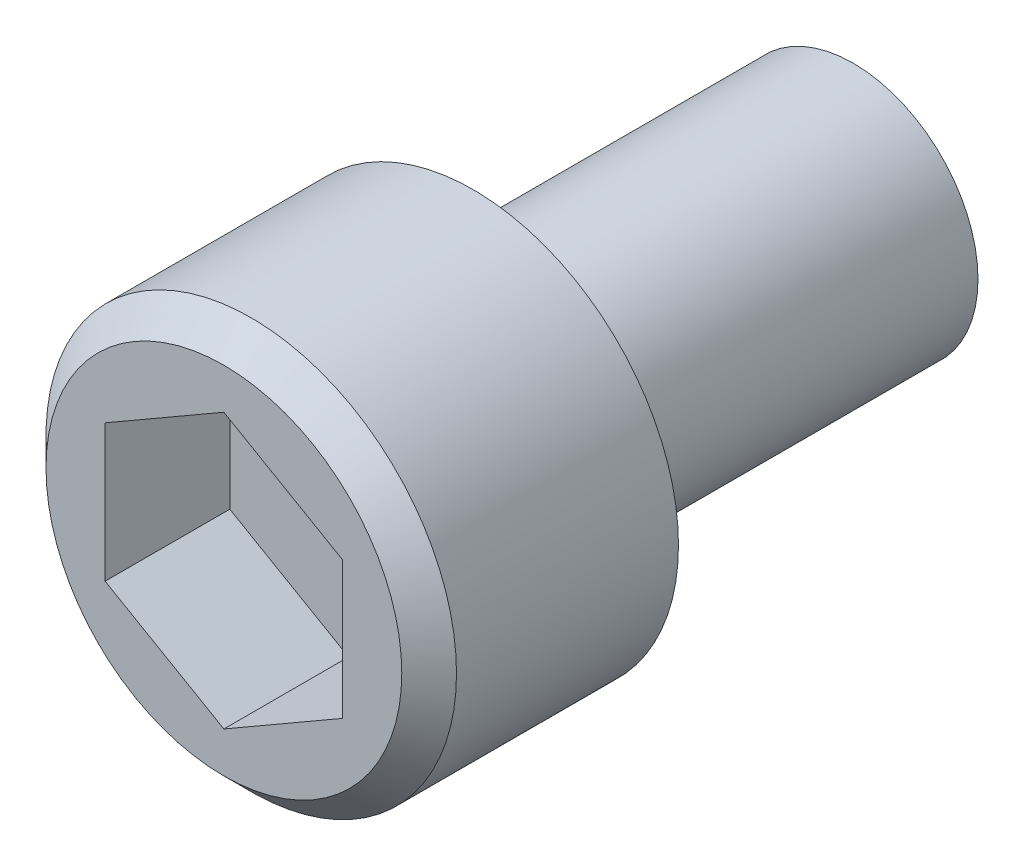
ISO-10303-21;
HEADER;
FILE_DESCRIPTION(('STEP AP214'),'2;1');
FILE_NAME('part.step','',(''),(''),'','','');
FILE_SCHEMA(('AUTOMOTIVE_DESIGN { 1 0 10303 214 1 1 1 1 }'));
ENDSEC;
DATA;
#1=APPLICATION_CONTEXT('core data for automotive mechanical design processes');
#2=APPLICATION_PROTOCOL_DEFINITION('international standard','automotive_design',2000,#1);
#3=PRODUCT_CONTEXT('',#1,'mechanical');
#4=PRODUCT('Part','Part','',(#3));
#5=PRODUCT_RELATED_PRODUCT_CATEGORY('part','',(#4));
#6=PRODUCT_DEFINITION_FORMATION('','',#4);
#7=PRODUCT_DEFINITION_CONTEXT('part definition',#1,'design');
#8=PRODUCT_DEFINITION('design','',#6,#7);
#9=PRODUCT_DEFINITION_SHAPE('','',#8);
#10=(LENGTH_UNIT() NAMED_UNIT(*) SI_UNIT(.MILLI.,.METRE.));
#11=(NAMED_UNIT(*) PLANE_ANGLE_UNIT() SI_UNIT($,.RADIAN.));
#12=(NAMED_UNIT(*) SI_UNIT($,.STERADIAN.) SOLID_ANGLE_UNIT());
#13=UNCERTAINTY_MEASURE_WITH_UNIT(LENGTH_MEASURE(1.E-05),#10,'distance_accuracy_value','');
#14=(GEOMETRIC_REPRESENTATION_CONTEXT(3) GLOBAL_UNCERTAINTY_ASSIGNED_CONTEXT((#13)) GLOBAL_UNIT_ASSIGNED_CONTEXT((#10,
#11,#12)) REPRESENTATION_CONTEXT('',''));
#15=CARTESIAN_POINT('',(0.,0.,0.));
#16=DIRECTION('',(0.,0.,1.));
#17=DIRECTION('',(1.,0.,0.));
#18=AXIS2_PLACEMENT_3D('',#15,#16,#17);
#19=CARTESIAN_POINT('',(0.,0.,6.35));
#20=DIRECTION('',(0.,0.,-1.));
#21=DIRECTION('',(-1.,0.,0.));
#22=AXIS2_PLACEMENT_3D('',#19,#20,#21);
#23=CYLINDRICAL_SURFACE('',#22,2.0828);
#24=CARTESIAN_POINT('',(0.,0.,6.0452));
#25=DIRECTION('',(0.,0.,1.));
#26=DIRECTION('',(1.,0.,0.));
#27=AXIS2_PLACEMENT_3D('',#24,#25,#26);
#28=CIRCLE('',#27,2.0828);
#29=CARTESIAN_POINT('',(2.0828,0.,6.0452));
#30=VERTEX_POINT('',#29);
#31=EDGE_CURVE('E154',#30,#30,#28,.F.);
#32=ORIENTED_EDGE('',*,*,#31,.T.);
#33=EDGE_LOOP('',(#32));
#34=FACE_BOUND('',#33,.T.);
#35=CARTESIAN_POINT('',(0.,0.,0.));
#36=DIRECTION('',(0.,0.,1.));
#37=DIRECTION('',(1.,0.,0.));
#38=AXIS2_PLACEMENT_3D('',#35,#36,#37);
#39=CIRCLE('',#38,2.0828);
#40=CARTESIAN_POINT('',(2.0828,0.,0.));
#41=VERTEX_POINT('',#40);
#42=EDGE_CURVE('E148',#41,#41,#39,.T.);
#43=ORIENTED_EDGE('',*,*,#42,.T.);
#44=EDGE_LOOP('',(#43));
#45=FACE_BOUND('',#44,.T.);
#46=ADVANCED_FACE('F38',(#34,#45),#23,.T.);
#47=CARTESIAN_POINT('',(0.,0.,0.));
#48=DIRECTION('',(0.,0.,1.));
#49=DIRECTION('',(1.,0.,0.));
#50=AXIS2_PLACEMENT_3D('',#47,#48,#49);
#51=PLANE('',#50);
#52=ORIENTED_EDGE('',*,*,#42,.F.);
#53=EDGE_LOOP('',(#52));
#54=FACE_BOUND('',#53,.T.);
#55=ADVANCED_FACE('F171',(#54),#51,.F.);
#56=CARTESIAN_POINT('',(0.,0.,6.35));
#57=DIRECTION('',(0.,0.,1.));
#58=DIRECTION('',(1.,0.,0.));
#59=AXIS2_PLACEMENT_3D('',#56,#57,#58);
#60=PLANE('',#59);
#61=CARTESIAN_POINT('',(0.,0.,6.35));
#62=DIRECTION('',(0.,0.,1.));
#63=DIRECTION('',(1.,0.,0.));
#64=AXIS2_PLACEMENT_3D('',#61,#62,#63);
#65=CIRCLE('',#64,2.3876);
#66=CARTESIAN_POINT('',(2.3876,0.,6.35));
#67=VERTEX_POINT('',#66);
#68=EDGE_CURVE('E151',#67,#67,#65,.T.);
#69=ORIENTED_EDGE('',*,*,#68,.T.);
#70=EDGE_LOOP('',(#69));
#71=FACE_BOUND('',#70,.T.);
#72=CARTESIAN_POINT('',(0.,0.,6.35));
#73=DIRECTION('',(0.,0.,1.));
#74=DIRECTION('',(1.,0.,0.));
#75=AXIS2_PLACEMENT_3D('',#72,#73,#74);
#76=CIRCLE('',#75,3.429);
#77=CARTESIAN_POINT('',(3.429,0.,6.35));
#78=VERTEX_POINT('',#77);
#79=EDGE_CURVE('E140',#78,#78,#76,.T.);
#80=ORIENTED_EDGE('',*,*,#79,.F.);
#81=EDGE_LOOP('',(#80));
#82=FACE_BOUND('',#81,.T.);
#83=ADVANCED_FACE('F177',(#71,#82),#60,.F.);
#84=CARTESIAN_POINT('',(0.,0.,10.5156));
#85=DIRECTION('',(0.,0.,-1.));
#86=DIRECTION('',(-1.,0.,0.));
#87=AXIS2_PLACEMENT_3D('',#84,#85,#86);
#88=CYLINDRICAL_SURFACE('',#87,3.429);
#89=CARTESIAN_POINT('',(0.,0.,10.0584));
#90=DIRECTION('',(0.,0.,1.));
#91=DIRECTION('',(1.,0.,0.));
#92=AXIS2_PLACEMENT_3D('',#89,#90,#91);
#93=CIRCLE('',#92,3.429);
#94=CARTESIAN_POINT('',(3.429,0.,10.0584));
#95=VERTEX_POINT('',#94);
#96=EDGE_CURVE('E11',#95,#95,#93,.F.);
#97=ORIENTED_EDGE('',*,*,#96,.T.);
#98=EDGE_LOOP('',(#97));
#99=FACE_BOUND('',#98,.T.);
#100=ORIENTED_EDGE('',*,*,#79,.T.);
#101=EDGE_LOOP('',(#100));
#102=FACE_BOUND('',#101,.T.);
#103=ADVANCED_FACE('F192',(#99,#102),#88,.T.);
#104=CARTESIAN_POINT('',(0.,0.,10.5156));
#105=DIRECTION('',(0.,0.,1.));
#106=DIRECTION('',(1.,0.,0.));
#107=AXIS2_PLACEMENT_3D('',#104,#105,#106);
#108=PLANE('',#107);
#109=CARTESIAN_POINT('',(0.,0.,10.5156));
#110=DIRECTION('',(0.,0.,1.));
#111=DIRECTION('',(1.,0.,0.));
#112=AXIS2_PLACEMENT_3D('',#109,#110,#111);
#113=CIRCLE('',#112,2.97179999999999);
#114=CARTESIAN_POINT('',(2.97179999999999,0.,10.5156));
#115=VERTEX_POINT('',#114);
#116=EDGE_CURVE('E46',#115,#115,#113,.T.);
#117=ORIENTED_EDGE('',*,*,#116,.T.);
#118=EDGE_LOOP('',(#117));
#119=FACE_BOUND('',#118,.T.);
#120=DIRECTION('',(-0.866025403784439,-0.5,0.));
#121=VECTOR('',#120,1.);
#122=CARTESIAN_POINT('',(0.,2.29135888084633,10.5156000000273));
#123=LINE('',#122,#121);
#124=CARTESIAN_POINT('',(0.,2.29135888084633,10.5156000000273));
#125=VERTEX_POINT('',#124);
#126=CARTESIAN_POINT('',(-1.984375,1.14567944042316,10.5156));
#127=VERTEX_POINT('',#126);
#128=EDGE_CURVE('E53',#125,#127,#123,.T.);
#129=ORIENTED_EDGE('',*,*,#128,.F.);
#130=DIRECTION('',(0.866025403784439,-0.5,0.));
#131=VECTOR('',#130,1.);
#132=CARTESIAN_POINT('',(0.,2.29135888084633,10.5156000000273));
#133=LINE('',#132,#131);
#134=CARTESIAN_POINT('',(1.984375,1.14567944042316,10.5156000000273));
#135=VERTEX_POINT('',#134);
#136=EDGE_CURVE('E135',#125,#135,#133,.T.);
#137=ORIENTED_EDGE('',*,*,#136,.T.);
#138=DIRECTION('',(0.,-1.,0.));
#139=VECTOR('',#138,1.);
#140=CARTESIAN_POINT('',(1.984375,1.14567944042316,10.5156000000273));
#141=LINE('',#140,#139);
#142=CARTESIAN_POINT('',(1.984375,-1.14567944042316,10.5156000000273));
#143=VERTEX_POINT('',#142);
#144=EDGE_CURVE('E133',#135,#143,#141,.T.);
#145=ORIENTED_EDGE('',*,*,#144,.T.);
#146=DIRECTION('',(0.866025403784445,0.499999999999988,0.));
#147=VECTOR('',#146,1.);
#148=CARTESIAN_POINT('',(0.,-2.29135888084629,10.5156000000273));
#149=LINE('',#148,#147);
#150=CARTESIAN_POINT('',(0.,-2.29135888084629,10.5156000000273));
#151=VERTEX_POINT('',#150);
#152=EDGE_CURVE('E110',#151,#143,#149,.T.);
#153=ORIENTED_EDGE('',*,*,#152,.F.);
#154=DIRECTION('',(-0.866025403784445,0.499999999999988,0.));
#155=VECTOR('',#154,1.);
#156=CARTESIAN_POINT('',(0.,-2.29135888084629,10.5156000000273));
#157=LINE('',#156,#155);
#158=CARTESIAN_POINT('',(-1.984375,-1.14567944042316,10.5156000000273));
#159=VERTEX_POINT('',#158);
#160=EDGE_CURVE('E129',#151,#159,#157,.T.);
#161=ORIENTED_EDGE('',*,*,#160,.T.);
#162=DIRECTION('',(0.,-1.,0.));
#163=VECTOR('',#162,1.);
#164=CARTESIAN_POINT('',(-1.984375,1.14567944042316,10.5156000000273));
#165=LINE('',#164,#163);
#166=EDGE_CURVE('E126',#127,#159,#165,.T.);
#167=ORIENTED_EDGE('',*,*,#166,.F.);
#168=EDGE_LOOP('',(#129,#137,#145,#153,#161,#167));
#169=FACE_BOUND('',#168,.T.);
#170=ADVANCED_FACE('F159',(#119,#169),#108,.T.);
#171=CARTESIAN_POINT('',(0.,0.,6.0452));
#172=DIRECTION('',(0.,0.,1.));
#173=DIRECTION('',(1.,0.,0.));
#174=AXIS2_PLACEMENT_3D('',#171,#172,#173);
#175=TOROIDAL_SURFACE('',#174,2.3876,0.3048);
#176=ORIENTED_EDGE('',*,*,#31,.F.);
#177=EDGE_LOOP('',(#176));
#178=FACE_BOUND('',#177,.T.);
#179=ORIENTED_EDGE('',*,*,#68,.F.);
#180=EDGE_LOOP('',(#179));
#181=FACE_BOUND('',#180,.T.);
#182=ADVANCED_FACE('F182',(#178,#181),#175,.F.);
#183=CARTESIAN_POINT('',(0.,2.29135888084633,8.43280000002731));
#184=DIRECTION('',(-0.5,0.866025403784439,0.));
#185=DIRECTION('',(-0.866025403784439,-0.5,0.));
#186=AXIS2_PLACEMENT_3D('',#183,#184,#185);
#187=PLANE('',#186);
#188=ORIENTED_EDGE('',*,*,#128,.T.);
#189=DIRECTION('',(0.,0.,1.));
#190=VECTOR('',#189,1.);
#191=CARTESIAN_POINT('',(-1.984375,1.14567944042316,8.43280000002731));
#192=LINE('',#191,#190);
#193=CARTESIAN_POINT('',(-1.984375,1.14567944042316,8.43280000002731));
#194=VERTEX_POINT('',#193);
#195=EDGE_CURVE('E83',#194,#127,#192,.T.);
#196=ORIENTED_EDGE('',*,*,#195,.F.);
#197=DIRECTION('',(-0.866025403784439,-0.5,0.));
#198=VECTOR('',#197,1.);
#199=CARTESIAN_POINT('',(0.,2.29135888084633,8.43280000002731));
#200=LINE('',#199,#198);
#201=CARTESIAN_POINT('',(0.,2.29135888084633,8.43280000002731));
#202=VERTEX_POINT('',#201);
#203=EDGE_CURVE('E138',#202,#194,#200,.T.);
#204=ORIENTED_EDGE('',*,*,#203,.F.);
#205=DIRECTION('',(0.,0.,1.));
#206=VECTOR('',#205,1.);
#207=CARTESIAN_POINT('',(0.,2.29135888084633,8.43280000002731));
#208=LINE('',#207,#206);
#209=EDGE_CURVE('E61',#202,#125,#208,.T.);
#210=ORIENTED_EDGE('',*,*,#209,.T.);
#211=EDGE_LOOP('',(#188,#196,#204,#210));
#212=FACE_BOUND('',#211,.T.);
#213=ADVANCED_FACE('F184',(#212),#187,.F.);
#214=CARTESIAN_POINT('',(0.,2.29135888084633,8.43280000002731));
#215=DIRECTION('',(-0.5,-0.866025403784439,0.));
#216=DIRECTION('',(0.866025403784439,-0.5,0.));
#217=AXIS2_PLACEMENT_3D('',#214,#215,#216);
#218=PLANE('',#217);
#219=ORIENTED_EDGE('',*,*,#136,.F.);
#220=ORIENTED_EDGE('',*,*,#209,.F.);
#221=DIRECTION('',(0.866025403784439,-0.5,0.));
#222=VECTOR('',#221,1.);
#223=CARTESIAN_POINT('',(0.,2.29135888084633,8.43280000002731));
#224=LINE('',#223,#222);
#225=CARTESIAN_POINT('',(1.984375,1.14567944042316,8.43280000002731));
#226=VERTEX_POINT('',#225);
#227=EDGE_CURVE('E103',#202,#226,#224,.T.);
#228=ORIENTED_EDGE('',*,*,#227,.T.);
#229=DIRECTION('',(0.,0.,1.));
#230=VECTOR('',#229,1.);
#231=CARTESIAN_POINT('',(1.984375,1.14567944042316,8.43280000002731));
#232=LINE('',#231,#230);
#233=EDGE_CURVE('E100',#226,#135,#232,.T.);
#234=ORIENTED_EDGE('',*,*,#233,.T.);
#235=EDGE_LOOP('',(#219,#220,#228,#234));
#236=FACE_BOUND('',#235,.T.);
#237=ADVANCED_FACE('F190',(#236),#218,.T.);
#238=CARTESIAN_POINT('',(1.984375,1.14567944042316,8.43280000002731));
#239=DIRECTION('',(-1.,0.,0.));
#240=DIRECTION('',(0.,0.,1.));
#241=AXIS2_PLACEMENT_3D('',#238,#239,#240);
#242=PLANE('',#241);
#243=ORIENTED_EDGE('',*,*,#144,.F.);
#244=ORIENTED_EDGE('',*,*,#233,.F.);
#245=DIRECTION('',(0.,-1.,0.));
#246=VECTOR('',#245,1.);
#247=CARTESIAN_POINT('',(1.984375,1.14567944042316,8.43280000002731));
#248=LINE('',#247,#246);
#249=CARTESIAN_POINT('',(1.984375,-1.14567944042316,8.43280000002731));
#250=VERTEX_POINT('',#249);
#251=EDGE_CURVE('E94',#226,#250,#248,.T.);
#252=ORIENTED_EDGE('',*,*,#251,.T.);
#253=DIRECTION('',(0.,0.,1.));
#254=VECTOR('',#253,1.);
#255=CARTESIAN_POINT('',(1.984375,-1.14567944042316,8.43280000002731));
#256=LINE('',#255,#254);
#257=EDGE_CURVE('E98',#250,#143,#256,.T.);
#258=ORIENTED_EDGE('',*,*,#257,.T.);
#259=EDGE_LOOP('',(#243,#244,#252,#258));
#260=FACE_BOUND('',#259,.T.);
#261=ADVANCED_FACE('F97',(#260),#242,.T.);
#262=CARTESIAN_POINT('',(0.,-2.29135888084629,8.43280000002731));
#263=DIRECTION('',(0.499999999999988,-0.866025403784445,0.));
#264=DIRECTION('',(0.866025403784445,0.499999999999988,0.));
#265=AXIS2_PLACEMENT_3D('',#262,#263,#264);
#266=PLANE('',#265);
#267=ORIENTED_EDGE('',*,*,#152,.T.);
#268=ORIENTED_EDGE('',*,*,#257,.F.);
#269=DIRECTION('',(0.866025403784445,0.499999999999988,0.));
#270=VECTOR('',#269,1.);
#271=CARTESIAN_POINT('',(0.,-2.29135888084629,8.43280000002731));
#272=LINE('',#271,#270);
#273=CARTESIAN_POINT('',(0.,-2.29135888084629,8.43280000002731));
#274=VERTEX_POINT('',#273);
#275=EDGE_CURVE('E104',#274,#250,#272,.T.);
#276=ORIENTED_EDGE('',*,*,#275,.F.);
#277=DIRECTION('',(0.,0.,1.));
#278=VECTOR('',#277,1.);
#279=CARTESIAN_POINT('',(0.,-2.29135888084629,8.43280000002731));
#280=LINE('',#279,#278);
#281=EDGE_CURVE('E112',#274,#151,#280,.T.);
#282=ORIENTED_EDGE('',*,*,#281,.T.);
#283=EDGE_LOOP('',(#267,#268,#276,#282));
#284=FACE_BOUND('',#283,.T.);
#285=ADVANCED_FACE('F108',(#284),#266,.F.);
#286=CARTESIAN_POINT('',(0.,-2.29135888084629,8.43280000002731));
#287=DIRECTION('',(0.499999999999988,0.866025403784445,0.));
#288=DIRECTION('',(-0.866025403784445,0.499999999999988,0.));
#289=AXIS2_PLACEMENT_3D('',#286,#287,#288);
#290=PLANE('',#289);
#291=ORIENTED_EDGE('',*,*,#160,.F.);
#292=ORIENTED_EDGE('',*,*,#281,.F.);
#293=DIRECTION('',(-0.866025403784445,0.499999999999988,0.));
#294=VECTOR('',#293,1.);
#295=CARTESIAN_POINT('',(0.,-2.29135888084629,8.43280000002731));
#296=LINE('',#295,#294);
#297=CARTESIAN_POINT('',(-1.984375,-1.14567944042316,8.43280000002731));
#298=VERTEX_POINT('',#297);
#299=EDGE_CURVE('E118',#274,#298,#296,.T.);
#300=ORIENTED_EDGE('',*,*,#299,.T.);
#301=DIRECTION('',(0.,0.,1.));
#302=VECTOR('',#301,1.);
#303=CARTESIAN_POINT('',(-1.984375,-1.14567944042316,8.43280000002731));
#304=LINE('',#303,#302);
#305=EDGE_CURVE('E143',#298,#159,#304,.T.);
#306=ORIENTED_EDGE('',*,*,#305,.T.);
#307=EDGE_LOOP('',(#291,#292,#300,#306));
#308=FACE_BOUND('',#307,.T.);
#309=ADVANCED_FACE('F210',(#308),#290,.T.);
#310=CARTESIAN_POINT('',(-1.984375,1.14567944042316,8.43280000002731));
#311=DIRECTION('',(-1.,0.,0.));
#312=DIRECTION('',(0.,0.,1.));
#313=AXIS2_PLACEMENT_3D('',#310,#311,#312);
#314=PLANE('',#313);
#315=ORIENTED_EDGE('',*,*,#166,.T.);
#316=ORIENTED_EDGE('',*,*,#305,.F.);
#317=DIRECTION('',(0.,-1.,0.));
#318=VECTOR('',#317,1.);
#319=CARTESIAN_POINT('',(-1.984375,1.14567944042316,8.43280000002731));
#320=LINE('',#319,#318);
#321=EDGE_CURVE('E120',#194,#298,#320,.T.);
#322=ORIENTED_EDGE('',*,*,#321,.F.);
#323=ORIENTED_EDGE('',*,*,#195,.T.);
#324=EDGE_LOOP('',(#315,#316,#322,#323));
#325=FACE_BOUND('',#324,.T.);
#326=ADVANCED_FACE('F167',(#325),#314,.F.);
#327=CARTESIAN_POINT('',(0.,2.29135888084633,8.43280000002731));
#328=DIRECTION('',(0.,0.,1.));
#329=DIRECTION('',(1.,0.,0.));
#330=AXIS2_PLACEMENT_3D('',#327,#328,#329);
#331=PLANE('',#330);
#332=ORIENTED_EDGE('',*,*,#203,.T.);
#333=ORIENTED_EDGE('',*,*,#321,.T.);
#334=ORIENTED_EDGE('',*,*,#299,.F.);
#335=ORIENTED_EDGE('',*,*,#275,.T.);
#336=ORIENTED_EDGE('',*,*,#251,.F.);
#337=ORIENTED_EDGE('',*,*,#227,.F.);
#338=EDGE_LOOP('',(#332,#333,#334,#335,#336,#337));
#339=FACE_BOUND('',#338,.T.);
#340=ADVANCED_FACE('F116',(#339),#331,.T.);
#341=CARTESIAN_POINT('',(0.,0.,10.5156));
#342=DIRECTION('',(0.,0.,-1.));
#343=DIRECTION('',(-1.,0.,0.));
#344=AXIS2_PLACEMENT_3D('',#341,#342,#343);
#345=CONICAL_SURFACE('',#344,2.97179999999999,0.785398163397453);
#346=ORIENTED_EDGE('',*,*,#96,.F.);
#347=EDGE_LOOP('',(#346));
#348=FACE_BOUND('',#347,.T.);
#349=ORIENTED_EDGE('',*,*,#116,.F.);
#350=EDGE_LOOP('',(#349));
#351=FACE_BOUND('',#350,.T.);
#352=ADVANCED_FACE('F40',(#348,#351),#345,.T.);
#353=CLOSED_SHELL('',(#46,#55,#83,#103,#170,#182,#213,#237,#261,#285,#309,#326,#340,#352));
#354=MANIFOLD_SOLID_BREP('B2',#353);
#355=ADVANCED_BREP_SHAPE_REPRESENTATION('',(#18,#354),#14);
#356=SHAPE_DEFINITION_REPRESENTATION(#9,#355);
ENDSEC;
END-ISO-10303-21;
